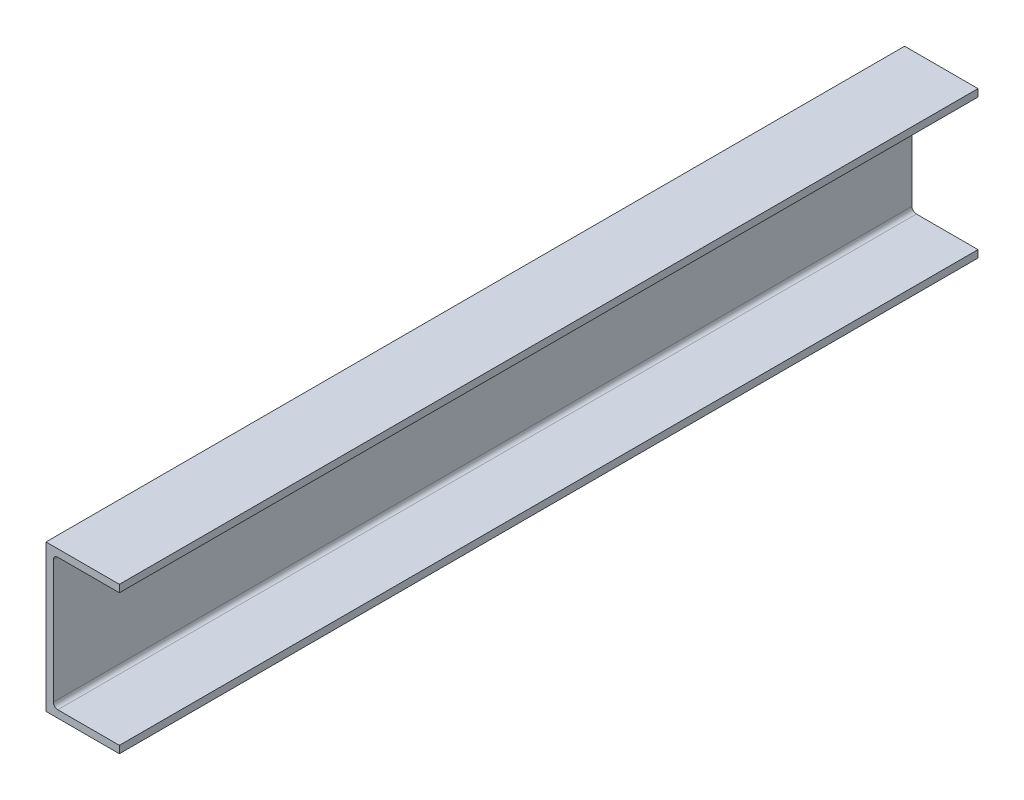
ISO-10303-21;
HEADER;
FILE_DESCRIPTION(('STEP AP214'),'2;1');
FILE_NAME('part.step','',(''),(''),'','','');
FILE_SCHEMA(('AUTOMOTIVE_DESIGN { 1 0 10303 214 1 1 1 1 }'));
ENDSEC;
DATA;
#1=APPLICATION_CONTEXT('core data for automotive mechanical design processes');
#2=APPLICATION_PROTOCOL_DEFINITION('international standard','automotive_design',2000,#1);
#3=PRODUCT_CONTEXT('',#1,'mechanical');
#4=PRODUCT('Part','Part','',(#3));
#5=PRODUCT_RELATED_PRODUCT_CATEGORY('part','',(#4));
#6=PRODUCT_DEFINITION_FORMATION('','',#4);
#7=PRODUCT_DEFINITION_CONTEXT('part definition',#1,'design');
#8=PRODUCT_DEFINITION('design','',#6,#7);
#9=PRODUCT_DEFINITION_SHAPE('','',#8);
#10=(LENGTH_UNIT() NAMED_UNIT(*) SI_UNIT(.MILLI.,.METRE.));
#11=(NAMED_UNIT(*) PLANE_ANGLE_UNIT() SI_UNIT($,.RADIAN.));
#12=(NAMED_UNIT(*) SI_UNIT($,.STERADIAN.) SOLID_ANGLE_UNIT());
#13=UNCERTAINTY_MEASURE_WITH_UNIT(LENGTH_MEASURE(1.E-05),#10,'distance_accuracy_value','');
#14=(GEOMETRIC_REPRESENTATION_CONTEXT(3) GLOBAL_UNCERTAINTY_ASSIGNED_CONTEXT((#13)) GLOBAL_UNIT_ASSIGNED_CONTEXT((#10,
#11,#12)) REPRESENTATION_CONTEXT('',''));
#15=CARTESIAN_POINT('',(0.,0.,0.));
#16=DIRECTION('',(0.,0.,1.));
#17=DIRECTION('',(1.,0.,0.));
#18=AXIS2_PLACEMENT_3D('',#15,#16,#17);
#19=CARTESIAN_POINT('',(8.,-8.00000000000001,585.));
#20=DIRECTION('',(0.,0.,-1.));
#21=DIRECTION('',(-1.,0.,0.));
#22=AXIS2_PLACEMENT_3D('',#19,#20,#21);
#23=CYLINDRICAL_SURFACE('',#22,3.);
#24=CARTESIAN_POINT('',(8.,-8.00000000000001,0.));
#25=DIRECTION('',(0.,0.,1.));
#26=DIRECTION('',(1.,0.,0.));
#27=AXIS2_PLACEMENT_3D('',#24,#25,#26);
#28=CIRCLE('',#27,3.);
#29=CARTESIAN_POINT('',(8.00000000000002,-5.,0.));
#30=VERTEX_POINT('',#29);
#31=CARTESIAN_POINT('',(5.,-8.00000000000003,0.));
#32=VERTEX_POINT('',#31);
#33=EDGE_CURVE('E141',#30,#32,#28,.T.);
#34=ORIENTED_EDGE('',*,*,#33,.F.);
#35=DIRECTION('',(0.,0.,-1.));
#36=VECTOR('',#35,1.);
#37=CARTESIAN_POINT('',(8.00000000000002,-5.,585.));
#38=LINE('',#37,#36);
#39=CARTESIAN_POINT('',(8.00000000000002,-5.,585.));
#40=VERTEX_POINT('',#39);
#41=EDGE_CURVE('E11',#40,#30,#38,.T.);
#42=ORIENTED_EDGE('',*,*,#41,.F.);
#43=CARTESIAN_POINT('',(8.,-8.00000000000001,585.));
#44=DIRECTION('',(0.,0.,1.));
#45=DIRECTION('',(1.,0.,0.));
#46=AXIS2_PLACEMENT_3D('',#43,#44,#45);
#47=CIRCLE('',#46,3.);
#48=CARTESIAN_POINT('',(5.,-8.00000000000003,585.));
#49=VERTEX_POINT('',#48);
#50=EDGE_CURVE('E164',#40,#49,#47,.T.);
#51=ORIENTED_EDGE('',*,*,#50,.T.);
#52=DIRECTION('',(0.,0.,-1.));
#53=VECTOR('',#52,1.);
#54=CARTESIAN_POINT('',(5.,-8.00000000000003,585.));
#55=LINE('',#54,#53);
#56=EDGE_CURVE('E91',#49,#32,#55,.T.);
#57=ORIENTED_EDGE('',*,*,#56,.T.);
#58=EDGE_LOOP('',(#34,#42,#51,#57));
#59=FACE_BOUND('',#58,.T.);
#60=ADVANCED_FACE('F35',(#59),#23,.F.);
#61=CARTESIAN_POINT('',(0.,-5.,585.));
#62=DIRECTION('',(0.,1.,0.));
#63=DIRECTION('',(0.,0.,1.));
#64=AXIS2_PLACEMENT_3D('',#61,#62,#63);
#65=PLANE('',#64);
#66=DIRECTION('',(1.,0.,0.));
#67=VECTOR('',#66,1.);
#68=CARTESIAN_POINT('',(0.,-5.,0.));
#69=LINE('',#68,#67);
#70=CARTESIAN_POINT('',(50.,-5.,0.));
#71=VERTEX_POINT('',#70);
#72=EDGE_CURVE('E144',#30,#71,#69,.T.);
#73=ORIENTED_EDGE('',*,*,#72,.T.);
#74=DIRECTION('',(0.,0.,-1.));
#75=VECTOR('',#74,1.);
#76=CARTESIAN_POINT('',(50.,-5.,585.));
#77=LINE('',#76,#75);
#78=CARTESIAN_POINT('',(50.,-5.,585.));
#79=VERTEX_POINT('',#78);
#80=EDGE_CURVE('E43',#79,#71,#77,.T.);
#81=ORIENTED_EDGE('',*,*,#80,.F.);
#82=DIRECTION('',(1.,0.,0.));
#83=VECTOR('',#82,1.);
#84=CARTESIAN_POINT('',(0.,-5.,585.));
#85=LINE('',#84,#83);
#86=EDGE_CURVE('E198',#40,#79,#85,.T.);
#87=ORIENTED_EDGE('',*,*,#86,.F.);
#88=ORIENTED_EDGE('',*,*,#41,.T.);
#89=EDGE_LOOP('',(#73,#81,#87,#88));
#90=FACE_BOUND('',#89,.T.);
#91=ADVANCED_FACE('F186',(#90),#65,.F.);
#92=CARTESIAN_POINT('',(50.,0.,585.));
#93=DIRECTION('',(1.,0.,0.));
#94=DIRECTION('',(0.,0.,-1.));
#95=AXIS2_PLACEMENT_3D('',#92,#93,#94);
#96=PLANE('',#95);
#97=DIRECTION('',(0.,-1.,0.));
#98=VECTOR('',#97,1.);
#99=CARTESIAN_POINT('',(50.,0.,0.));
#100=LINE('',#99,#98);
#101=CARTESIAN_POINT('',(50.,0.,0.));
#102=VERTEX_POINT('',#101);
#103=EDGE_CURVE('E147',#102,#71,#100,.T.);
#104=ORIENTED_EDGE('',*,*,#103,.F.);
#105=DIRECTION('',(0.,0.,-1.));
#106=VECTOR('',#105,1.);
#107=CARTESIAN_POINT('',(50.,0.,585.));
#108=LINE('',#107,#106);
#109=CARTESIAN_POINT('',(50.,0.,585.));
#110=VERTEX_POINT('',#109);
#111=EDGE_CURVE('E176',#110,#102,#108,.T.);
#112=ORIENTED_EDGE('',*,*,#111,.F.);
#113=DIRECTION('',(0.,-1.,0.));
#114=VECTOR('',#113,1.);
#115=CARTESIAN_POINT('',(50.,0.,585.));
#116=LINE('',#115,#114);
#117=EDGE_CURVE('E183',#110,#79,#116,.T.);
#118=ORIENTED_EDGE('',*,*,#117,.T.);
#119=ORIENTED_EDGE('',*,*,#80,.T.);
#120=EDGE_LOOP('',(#104,#112,#118,#119));
#121=FACE_BOUND('',#120,.T.);
#122=ADVANCED_FACE('F181',(#121),#96,.T.);
#123=CARTESIAN_POINT('',(0.,0.,585.));
#124=DIRECTION('',(0.,1.,0.));
#125=DIRECTION('',(0.,0.,1.));
#126=AXIS2_PLACEMENT_3D('',#123,#124,#125);
#127=PLANE('',#126);
#128=DIRECTION('',(1.,0.,0.));
#129=VECTOR('',#128,1.);
#130=CARTESIAN_POINT('',(0.,0.,0.));
#131=LINE('',#130,#129);
#132=CARTESIAN_POINT('',(0.,0.,0.));
#133=VERTEX_POINT('',#132);
#134=EDGE_CURVE('E150',#133,#102,#131,.T.);
#135=ORIENTED_EDGE('',*,*,#134,.F.);
#136=DIRECTION('',(0.,0.,-1.));
#137=VECTOR('',#136,1.);
#138=CARTESIAN_POINT('',(0.,0.,585.));
#139=LINE('',#138,#137);
#140=CARTESIAN_POINT('',(0.,0.,585.));
#141=VERTEX_POINT('',#140);
#142=EDGE_CURVE('E174',#141,#133,#139,.T.);
#143=ORIENTED_EDGE('',*,*,#142,.F.);
#144=DIRECTION('',(1.,0.,0.));
#145=VECTOR('',#144,1.);
#146=CARTESIAN_POINT('',(0.,0.,585.));
#147=LINE('',#146,#145);
#148=EDGE_CURVE('E197',#141,#110,#147,.T.);
#149=ORIENTED_EDGE('',*,*,#148,.T.);
#150=ORIENTED_EDGE('',*,*,#111,.T.);
#151=EDGE_LOOP('',(#135,#143,#149,#150));
#152=FACE_BOUND('',#151,.T.);
#153=ADVANCED_FACE('F193',(#152),#127,.T.);
#154=CARTESIAN_POINT('',(0.,0.,585.));
#155=DIRECTION('',(1.,0.,0.));
#156=DIRECTION('',(0.,1.,0.));
#157=AXIS2_PLACEMENT_3D('',#154,#155,#156);
#158=PLANE('',#157);
#159=DIRECTION('',(0.,-1.,0.));
#160=VECTOR('',#159,1.);
#161=CARTESIAN_POINT('',(0.,0.,0.));
#162=LINE('',#161,#160);
#163=CARTESIAN_POINT('',(0.,-100.,0.));
#164=VERTEX_POINT('',#163);
#165=EDGE_CURVE('E153',#133,#164,#162,.T.);
#166=ORIENTED_EDGE('',*,*,#165,.T.);
#167=DIRECTION('',(0.,0.,-1.));
#168=VECTOR('',#167,1.);
#169=CARTESIAN_POINT('',(0.,-100.,585.));
#170=LINE('',#169,#168);
#171=CARTESIAN_POINT('',(0.,-100.,585.));
#172=VERTEX_POINT('',#171);
#173=EDGE_CURVE('E171',#172,#164,#170,.T.);
#174=ORIENTED_EDGE('',*,*,#173,.F.);
#175=DIRECTION('',(0.,-1.,0.));
#176=VECTOR('',#175,1.);
#177=CARTESIAN_POINT('',(0.,0.,585.));
#178=LINE('',#177,#176);
#179=EDGE_CURVE('E200',#141,#172,#178,.T.);
#180=ORIENTED_EDGE('',*,*,#179,.F.);
#181=ORIENTED_EDGE('',*,*,#142,.T.);
#182=EDGE_LOOP('',(#166,#174,#180,#181));
#183=FACE_BOUND('',#182,.T.);
#184=ADVANCED_FACE('F227',(#183),#158,.F.);
#185=CARTESIAN_POINT('',(0.,-100.,585.));
#186=DIRECTION('',(0.,1.,0.));
#187=DIRECTION('',(0.,0.,1.));
#188=AXIS2_PLACEMENT_3D('',#185,#186,#187);
#189=PLANE('',#188);
#190=DIRECTION('',(1.,0.,0.));
#191=VECTOR('',#190,1.);
#192=CARTESIAN_POINT('',(0.,-100.,0.));
#193=LINE('',#192,#191);
#194=CARTESIAN_POINT('',(50.,-100.,0.));
#195=VERTEX_POINT('',#194);
#196=EDGE_CURVE('E155',#164,#195,#193,.T.);
#197=ORIENTED_EDGE('',*,*,#196,.T.);
#198=DIRECTION('',(0.,0.,-1.));
#199=VECTOR('',#198,1.);
#200=CARTESIAN_POINT('',(50.,-100.,585.));
#201=LINE('',#200,#199);
#202=CARTESIAN_POINT('',(50.,-100.,585.));
#203=VERTEX_POINT('',#202);
#204=EDGE_CURVE('E168',#203,#195,#201,.T.);
#205=ORIENTED_EDGE('',*,*,#204,.F.);
#206=DIRECTION('',(1.,0.,0.));
#207=VECTOR('',#206,1.);
#208=CARTESIAN_POINT('',(0.,-100.,585.));
#209=LINE('',#208,#207);
#210=EDGE_CURVE('E206',#172,#203,#209,.T.);
#211=ORIENTED_EDGE('',*,*,#210,.F.);
#212=ORIENTED_EDGE('',*,*,#173,.T.);
#213=EDGE_LOOP('',(#197,#205,#211,#212));
#214=FACE_BOUND('',#213,.T.);
#215=ADVANCED_FACE('F211',(#214),#189,.F.);
#216=CARTESIAN_POINT('',(50.,0.,585.));
#217=DIRECTION('',(-1.,0.,0.));
#218=DIRECTION('',(0.,0.,1.));
#219=AXIS2_PLACEMENT_3D('',#216,#217,#218);
#220=PLANE('',#219);
#221=DIRECTION('',(0.,1.,0.));
#222=VECTOR('',#221,1.);
#223=CARTESIAN_POINT('',(50.,0.,0.));
#224=LINE('',#223,#222);
#225=CARTESIAN_POINT('',(50.,-95.,0.));
#226=VERTEX_POINT('',#225);
#227=EDGE_CURVE('E157',#195,#226,#224,.T.);
#228=ORIENTED_EDGE('',*,*,#227,.T.);
#229=DIRECTION('',(0.,0.,-1.));
#230=VECTOR('',#229,1.);
#231=CARTESIAN_POINT('',(50.,-95.,585.));
#232=LINE('',#231,#230);
#233=CARTESIAN_POINT('',(50.,-95.,585.));
#234=VERTEX_POINT('',#233);
#235=EDGE_CURVE('E134',#234,#226,#232,.T.);
#236=ORIENTED_EDGE('',*,*,#235,.F.);
#237=DIRECTION('',(0.,1.,0.));
#238=VECTOR('',#237,1.);
#239=CARTESIAN_POINT('',(50.,0.,585.));
#240=LINE('',#239,#238);
#241=EDGE_CURVE('E121',#203,#234,#240,.T.);
#242=ORIENTED_EDGE('',*,*,#241,.F.);
#243=ORIENTED_EDGE('',*,*,#204,.T.);
#244=EDGE_LOOP('',(#228,#236,#242,#243));
#245=FACE_BOUND('',#244,.T.);
#246=ADVANCED_FACE('F214',(#245),#220,.F.);
#247=CARTESIAN_POINT('',(0.,-95.,585.));
#248=DIRECTION('',(0.,-1.,0.));
#249=DIRECTION('',(0.,0.,-1.));
#250=AXIS2_PLACEMENT_3D('',#247,#248,#249);
#251=PLANE('',#250);
#252=DIRECTION('',(-1.,0.,0.));
#253=VECTOR('',#252,1.);
#254=CARTESIAN_POINT('',(0.,-95.,0.));
#255=LINE('',#254,#253);
#256=CARTESIAN_POINT('',(8.00000000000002,-95.,0.));
#257=VERTEX_POINT('',#256);
#258=EDGE_CURVE('E130',#226,#257,#255,.T.);
#259=ORIENTED_EDGE('',*,*,#258,.T.);
#260=DIRECTION('',(0.,0.,-1.));
#261=VECTOR('',#260,1.);
#262=CARTESIAN_POINT('',(8.00000000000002,-95.,585.));
#263=LINE('',#262,#261);
#264=CARTESIAN_POINT('',(8.00000000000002,-95.,585.));
#265=VERTEX_POINT('',#264);
#266=EDGE_CURVE('E127',#265,#257,#263,.T.);
#267=ORIENTED_EDGE('',*,*,#266,.F.);
#268=DIRECTION('',(-1.,0.,0.));
#269=VECTOR('',#268,1.);
#270=CARTESIAN_POINT('',(0.,-95.,585.));
#271=LINE('',#270,#269);
#272=EDGE_CURVE('E115',#234,#265,#271,.T.);
#273=ORIENTED_EDGE('',*,*,#272,.F.);
#274=ORIENTED_EDGE('',*,*,#235,.T.);
#275=EDGE_LOOP('',(#259,#267,#273,#274));
#276=FACE_BOUND('',#275,.T.);
#277=ADVANCED_FACE('F128',(#276),#251,.F.);
#278=CARTESIAN_POINT('',(8.,-92.,585.));
#279=DIRECTION('',(0.,0.,-1.));
#280=DIRECTION('',(-1.,0.,0.));
#281=AXIS2_PLACEMENT_3D('',#278,#279,#280);
#282=CYLINDRICAL_SURFACE('',#281,3.);
#283=CARTESIAN_POINT('',(8.,-92.,0.));
#284=DIRECTION('',(0.,0.,1.));
#285=DIRECTION('',(1.,0.,0.));
#286=AXIS2_PLACEMENT_3D('',#283,#284,#285);
#287=CIRCLE('',#286,3.);
#288=CARTESIAN_POINT('',(5.,-92.,0.));
#289=VERTEX_POINT('',#288);
#290=EDGE_CURVE('E160',#289,#257,#287,.T.);
#291=ORIENTED_EDGE('',*,*,#290,.F.);
#292=DIRECTION('',(0.,0.,-1.));
#293=VECTOR('',#292,1.);
#294=CARTESIAN_POINT('',(5.,-92.,585.));
#295=LINE('',#294,#293);
#296=CARTESIAN_POINT('',(5.,-92.,585.));
#297=VERTEX_POINT('',#296);
#298=EDGE_CURVE('E84',#297,#289,#295,.T.);
#299=ORIENTED_EDGE('',*,*,#298,.F.);
#300=CARTESIAN_POINT('',(8.,-92.,585.));
#301=DIRECTION('',(0.,0.,1.));
#302=DIRECTION('',(1.,0.,0.));
#303=AXIS2_PLACEMENT_3D('',#300,#301,#302);
#304=CIRCLE('',#303,3.);
#305=EDGE_CURVE('E119',#297,#265,#304,.T.);
#306=ORIENTED_EDGE('',*,*,#305,.T.);
#307=ORIENTED_EDGE('',*,*,#266,.T.);
#308=EDGE_LOOP('',(#291,#299,#306,#307));
#309=FACE_BOUND('',#308,.T.);
#310=ADVANCED_FACE('F136',(#309),#282,.F.);
#311=CARTESIAN_POINT('',(5.,0.,585.));
#312=DIRECTION('',(-1.,0.,0.));
#313=DIRECTION('',(0.,0.,1.));
#314=AXIS2_PLACEMENT_3D('',#311,#312,#313);
#315=PLANE('',#314);
#316=DIRECTION('',(0.,1.,0.));
#317=VECTOR('',#316,1.);
#318=CARTESIAN_POINT('',(5.,0.,0.));
#319=LINE('',#318,#317);
#320=EDGE_CURVE('E162',#289,#32,#319,.T.);
#321=ORIENTED_EDGE('',*,*,#320,.T.);
#322=ORIENTED_EDGE('',*,*,#56,.F.);
#323=DIRECTION('',(0.,1.,0.));
#324=VECTOR('',#323,1.);
#325=CARTESIAN_POINT('',(5.,0.,585.));
#326=LINE('',#325,#324);
#327=EDGE_CURVE('E51',#297,#49,#326,.T.);
#328=ORIENTED_EDGE('',*,*,#327,.F.);
#329=ORIENTED_EDGE('',*,*,#298,.T.);
#330=EDGE_LOOP('',(#321,#322,#328,#329));
#331=FACE_BOUND('',#330,.T.);
#332=ADVANCED_FACE('F215',(#331),#315,.F.);
#333=CARTESIAN_POINT('',(0.,0.,585.));
#334=DIRECTION('',(0.,0.,1.));
#335=DIRECTION('',(1.,0.,0.));
#336=AXIS2_PLACEMENT_3D('',#333,#334,#335);
#337=PLANE('',#336);
#338=ORIENTED_EDGE('',*,*,#50,.F.);
#339=ORIENTED_EDGE('',*,*,#86,.T.);
#340=ORIENTED_EDGE('',*,*,#117,.F.);
#341=ORIENTED_EDGE('',*,*,#148,.F.);
#342=ORIENTED_EDGE('',*,*,#179,.T.);
#343=ORIENTED_EDGE('',*,*,#210,.T.);
#344=ORIENTED_EDGE('',*,*,#241,.T.);
#345=ORIENTED_EDGE('',*,*,#272,.T.);
#346=ORIENTED_EDGE('',*,*,#305,.F.);
#347=ORIENTED_EDGE('',*,*,#327,.T.);
#348=EDGE_LOOP('',(#338,#339,#340,#341,#342,#343,#344,#345,#346,#347));
#349=FACE_BOUND('',#348,.T.);
#350=ADVANCED_FACE('F117',(#349),#337,.T.);
#351=CARTESIAN_POINT('',(0.,0.,0.));
#352=DIRECTION('',(0.,0.,1.));
#353=DIRECTION('',(1.,0.,0.));
#354=AXIS2_PLACEMENT_3D('',#351,#352,#353);
#355=PLANE('',#354);
#356=ORIENTED_EDGE('',*,*,#33,.T.);
#357=ORIENTED_EDGE('',*,*,#320,.F.);
#358=ORIENTED_EDGE('',*,*,#290,.T.);
#359=ORIENTED_EDGE('',*,*,#258,.F.);
#360=ORIENTED_EDGE('',*,*,#227,.F.);
#361=ORIENTED_EDGE('',*,*,#196,.F.);
#362=ORIENTED_EDGE('',*,*,#165,.F.);
#363=ORIENTED_EDGE('',*,*,#134,.T.);
#364=ORIENTED_EDGE('',*,*,#103,.T.);
#365=ORIENTED_EDGE('',*,*,#72,.F.);
#366=EDGE_LOOP('',(#356,#357,#358,#359,#360,#361,#362,#363,#364,#365));
#367=FACE_BOUND('',#366,.T.);
#368=ADVANCED_FACE('F188',(#367),#355,.F.);
#369=CLOSED_SHELL('',(#60,#91,#122,#153,#184,#215,#246,#277,#310,#332,#350,#368));
#370=MANIFOLD_SOLID_BREP('B2',#369);
#371=ADVANCED_BREP_SHAPE_REPRESENTATION('',(#18,#370),#14);
#372=SHAPE_DEFINITION_REPRESENTATION(#9,#371);
ENDSEC;
END-ISO-10303-21;
